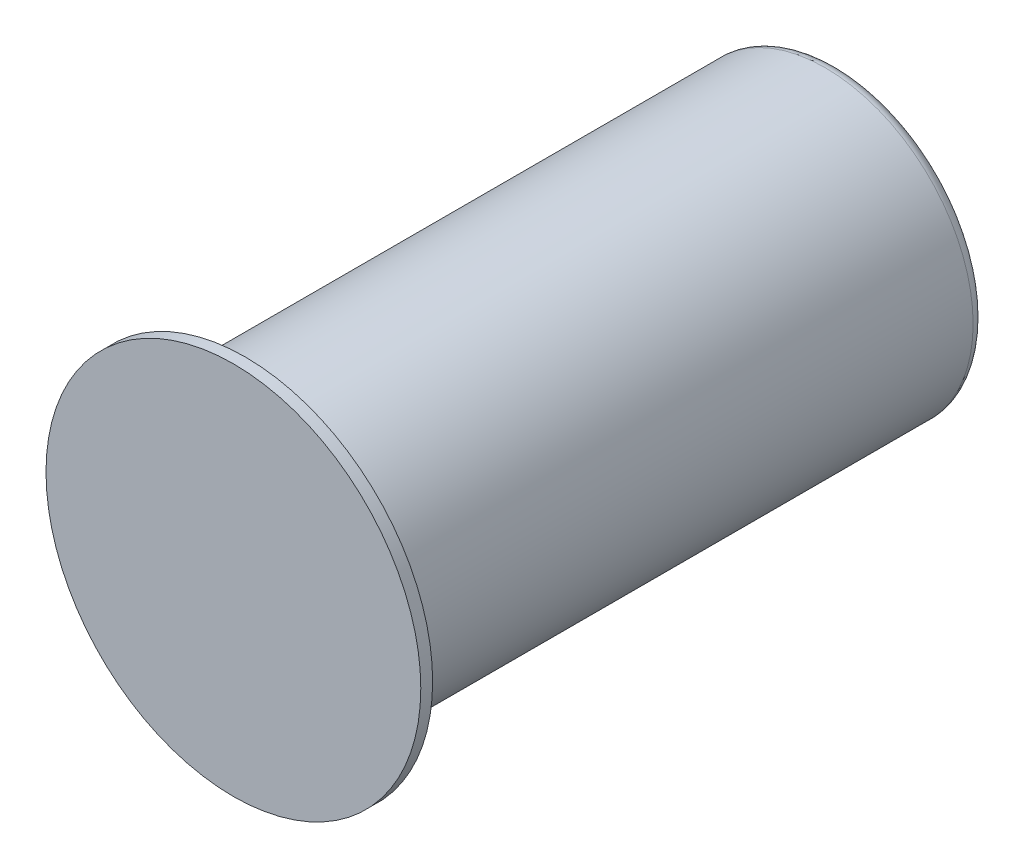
from build123d import *


with BuildPart() as part:
    # Sketch1 → Revolve1 (revolve)
    with BuildSketch(Plane(origin=(0, 0, 0), x_dir=(0, 0, -1), z_dir=(1, 0, 0)), mode=Mode.PRIVATE) as revolve1_sk:
        with BuildLine():
            Line((0, 0), (0, 47.5))
            Line((0, 47.5), (3, 47.5))
            Line((3, 47.5), (3, 37.5))
            Line((3, 37.5), (150, 37.5))
            ThreePointArc((150, 37.5), (152.121320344, 36.621320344), (153, 34.5))
            Line((153, 34.5), (153, 6))
            Line((153, 6), (152, 5))
            Line((152, 5), (141, 5))
            Line((141, 5), (138.113248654, 0))
            Line((138.113248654, 0), (0, 0))
        make_face()
    revolve(revolve1_sk.sketch.rotate(Axis((0, 0, 0), (0, 0, -1)), 90), axis=Axis((0, 0, 0), (0, 0, -1)))


solid = part.part
